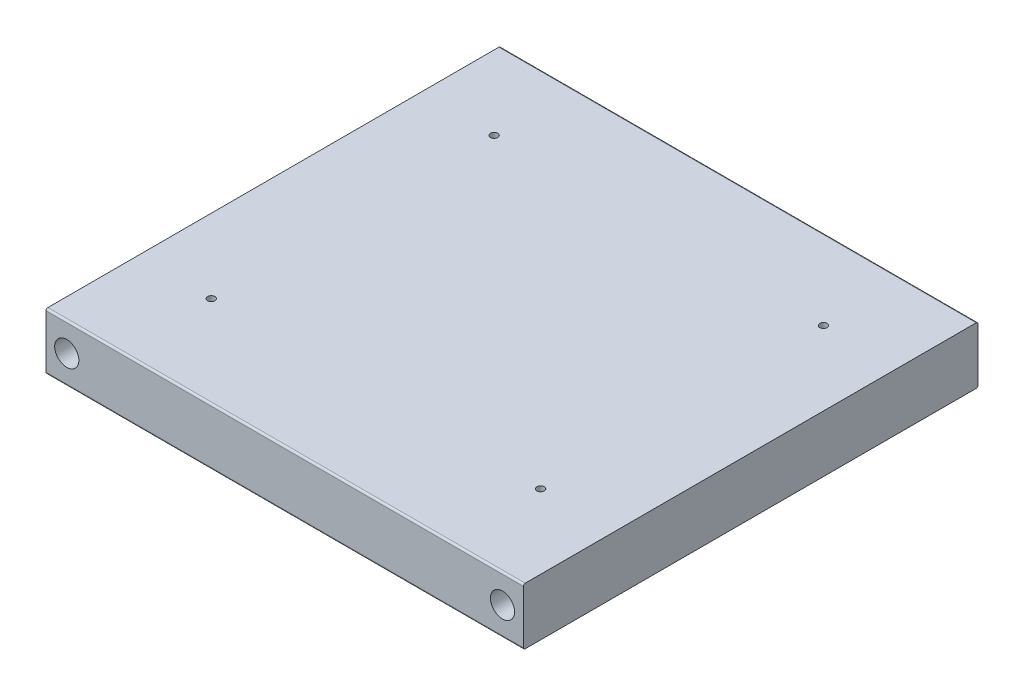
from build123d import *

# Parameters (mm, degrees)
BOSS_EXTRUDE1_DEPTH      = 7.9375
BOSS_EXTRUDE1_DEPTH_BACK = 7.9375
SKETCH3_W                = 133.35
SKETCH3_H                = 127
FILLET1_R                = 0.523875
M2_5X0_45_TAPPED_HOLE1_D = 2.05
CUT_EXTRUDE1_REACH       = 145.658
SKETCH7_R                = 3.3782


with BuildPart() as part:
    # Sketch3 → Boss-Extrude1 (new, two sides: drawn at the far end of the back side and taken through both)
    with BuildSketch(Plane(origin=(0, 0, 0), x_dir=(1, 0, 0), z_dir=(0, 1, 0)).offset(-BOSS_EXTRUDE1_DEPTH_BACK)):
        Rectangle(SKETCH3_W, SKETCH3_H)
    extrude(amount=BOSS_EXTRUDE1_DEPTH + BOSS_EXTRUDE1_DEPTH_BACK)

    # Fillet1
    fillet1_edges = [part.edges().sort_by_distance(p)[0] for p in [
        (0, -7.9375, -63.5),
        (0, -7.9375, 63.5),
        (0, 7.9375, -63.5),
        (0, 7.9375, 63.5),
    ]]
    fillet(fillet1_edges, radius=FILLET1_R)

    # M2.5x0.45 Tapped Hole1 (through all)
    with Locations(Plane(origin=(0, -7.9375, 0), x_dir=(-1, 0, 0), z_dir=(0, -1, 0))):
        with Locations((-46.000000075, 41), (45.999999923, 41), (45.999999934, -38), (-46.000000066, -38)):
            Hole(M2_5X0_45_TAPPED_HOLE1_D / 2)

    # Sketch7 → Cut-Extrude1 (cut, up to next)
    with BuildSketch(Plane.XY.offset(63.5), mode=Mode.PRIVATE) as cut_extrude1_sk1:
        with Locations((-60.876950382, 0.003909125)):
            Circle(SKETCH7_R)
    cut_extrude1_tool1 = extrude(cut_extrude1_sk1.sketch, amount=-CUT_EXTRUDE1_REACH, mode=Mode.PRIVATE) & part.part
    # Sketch7 → Cut-Extrude1 (cut, up to next)
    with BuildSketch(Plane.XY.offset(63.5), mode=Mode.PRIVATE) as cut_extrude1_sk2:
        with Locations((60.837500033, 0.001954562)):
            Circle(SKETCH7_R)
    cut_extrude1_tool2 = extrude(cut_extrude1_sk2.sketch, amount=-CUT_EXTRUDE1_REACH, mode=Mode.PRIVATE) & part.part
    add(cut_extrude1_tool1.solids().sort_by_distance((-60.87695, 0.003909, 63.5))[0], mode=Mode.SUBTRACT)
    add(cut_extrude1_tool2.solids().sort_by_distance((60.8375, 0.001955, 63.5))[0], mode=Mode.SUBTRACT)


solid = part.part
